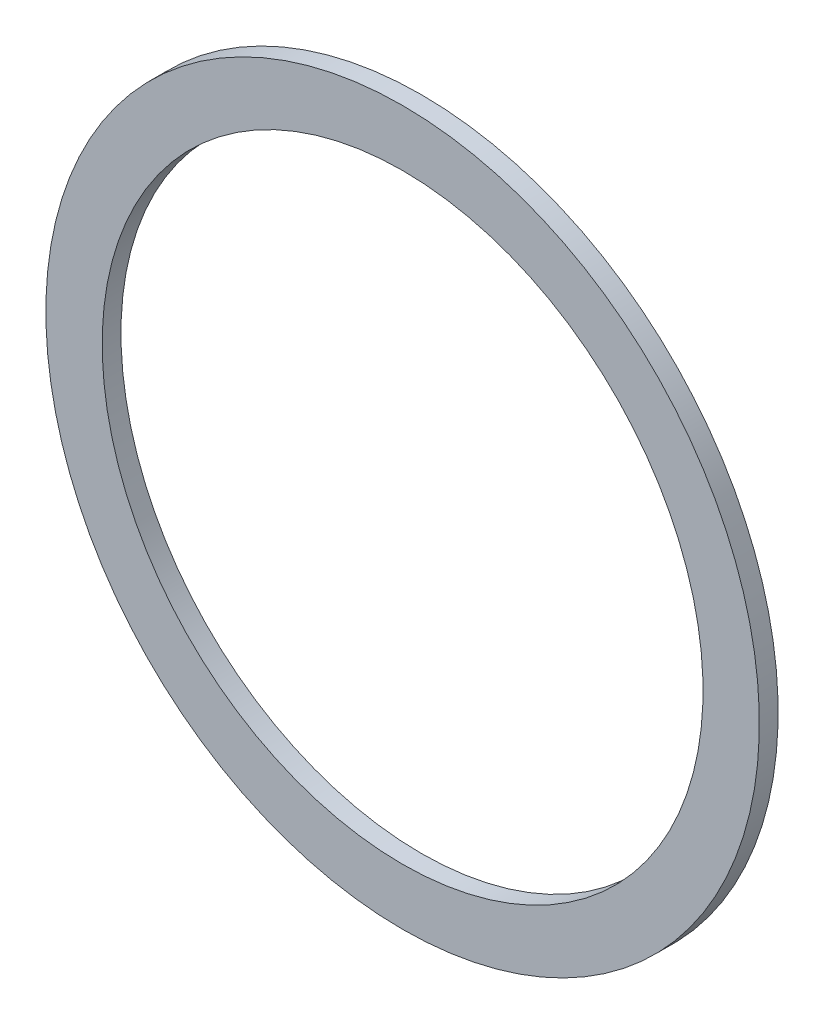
ISO-10303-21;
HEADER;
FILE_DESCRIPTION(('STEP AP214'),'2;1');
FILE_NAME('part.step','',(''),(''),'','','');
FILE_SCHEMA(('AUTOMOTIVE_DESIGN { 1 0 10303 214 1 1 1 1 }'));
ENDSEC;
DATA;
#1=APPLICATION_CONTEXT('core data for automotive mechanical design processes');
#2=APPLICATION_PROTOCOL_DEFINITION('international standard','automotive_design',2000,#1);
#3=PRODUCT_CONTEXT('',#1,'mechanical');
#4=PRODUCT('Part','Part','',(#3));
#5=PRODUCT_RELATED_PRODUCT_CATEGORY('part','',(#4));
#6=PRODUCT_DEFINITION_FORMATION('','',#4);
#7=PRODUCT_DEFINITION_CONTEXT('part definition',#1,'design');
#8=PRODUCT_DEFINITION('design','',#6,#7);
#9=PRODUCT_DEFINITION_SHAPE('','',#8);
#10=(LENGTH_UNIT() NAMED_UNIT(*) SI_UNIT(.MILLI.,.METRE.));
#11=(NAMED_UNIT(*) PLANE_ANGLE_UNIT() SI_UNIT($,.RADIAN.));
#12=(NAMED_UNIT(*) SI_UNIT($,.STERADIAN.) SOLID_ANGLE_UNIT());
#13=UNCERTAINTY_MEASURE_WITH_UNIT(LENGTH_MEASURE(1.E-05),#10,'distance_accuracy_value','');
#14=(GEOMETRIC_REPRESENTATION_CONTEXT(3) GLOBAL_UNCERTAINTY_ASSIGNED_CONTEXT((#13)) GLOBAL_UNIT_ASSIGNED_CONTEXT((#10,
#11,#12)) REPRESENTATION_CONTEXT('',''));
#15=CARTESIAN_POINT('',(0.,0.,0.));
#16=DIRECTION('',(0.,0.,1.));
#17=DIRECTION('',(1.,0.,0.));
#18=AXIS2_PLACEMENT_3D('',#15,#16,#17);
#19=CARTESIAN_POINT('',(0.,0.,0.));
#20=DIRECTION('',(0.,0.,-1.));
#21=DIRECTION('',(0.,-1.,0.));
#22=AXIS2_PLACEMENT_3D('',#19,#20,#21);
#23=CYLINDRICAL_SURFACE('',#22,16.);
#24=CARTESIAN_POINT('',(0.,0.,0.));
#25=DIRECTION('',(0.,0.,1.));
#26=DIRECTION('',(0.,1.,0.));
#27=AXIS2_PLACEMENT_3D('',#24,#25,#26);
#28=CIRCLE('',#27,16.);
#29=CARTESIAN_POINT('',(0.,16.,0.));
#30=VERTEX_POINT('',#29);
#31=EDGE_CURVE('E11',#30,#30,#28,.T.);
#32=ORIENTED_EDGE('',*,*,#31,.T.);
#33=EDGE_LOOP('',(#32));
#34=FACE_BOUND('',#33,.T.);
#35=CARTESIAN_POINT('',(0.,0.,-1.));
#36=DIRECTION('',(0.,0.,1.));
#37=DIRECTION('',(0.,1.,0.));
#38=AXIS2_PLACEMENT_3D('',#35,#36,#37);
#39=CIRCLE('',#38,16.);
#40=CARTESIAN_POINT('',(0.,-16.,-1.));
#41=VERTEX_POINT('',#40);
#42=EDGE_CURVE('E62',#41,#41,#39,.T.);
#43=ORIENTED_EDGE('',*,*,#42,.F.);
#44=EDGE_LOOP('',(#43));
#45=FACE_BOUND('',#44,.T.);
#46=ADVANCED_FACE('F16',(#34,#45),#23,.F.);
#47=CARTESIAN_POINT('',(0.,0.,0.));
#48=DIRECTION('',(0.,0.,-1.));
#49=DIRECTION('',(0.,-1.,0.));
#50=AXIS2_PLACEMENT_3D('',#47,#48,#49);
#51=CYLINDRICAL_SURFACE('',#50,19.);
#52=CARTESIAN_POINT('',(0.,0.,0.));
#53=DIRECTION('',(0.,0.,1.));
#54=DIRECTION('',(0.,1.,0.));
#55=AXIS2_PLACEMENT_3D('',#52,#53,#54);
#56=CIRCLE('',#55,19.);
#57=CARTESIAN_POINT('',(0.,-19.,0.));
#58=VERTEX_POINT('',#57);
#59=EDGE_CURVE('E46',#58,#58,#56,.T.);
#60=ORIENTED_EDGE('',*,*,#59,.F.);
#61=EDGE_LOOP('',(#60));
#62=FACE_BOUND('',#61,.T.);
#63=CARTESIAN_POINT('',(0.,0.,-1.));
#64=DIRECTION('',(0.,0.,1.));
#65=DIRECTION('',(0.,1.,0.));
#66=AXIS2_PLACEMENT_3D('',#63,#64,#65);
#67=CIRCLE('',#66,19.);
#68=CARTESIAN_POINT('',(0.,-19.,-1.));
#69=VERTEX_POINT('',#68);
#70=EDGE_CURVE('E26',#69,#69,#67,.T.);
#71=ORIENTED_EDGE('',*,*,#70,.T.);
#72=EDGE_LOOP('',(#71));
#73=FACE_BOUND('',#72,.T.);
#74=ADVANCED_FACE('F69',(#62,#73),#51,.T.);
#75=CARTESIAN_POINT('',(0.,0.,0.));
#76=DIRECTION('',(0.,0.,1.));
#77=DIRECTION('',(-1.,0.,0.));
#78=AXIS2_PLACEMENT_3D('',#75,#76,#77);
#79=PLANE('',#78);
#80=ORIENTED_EDGE('',*,*,#59,.T.);
#81=EDGE_LOOP('',(#80));
#82=FACE_BOUND('',#81,.T.);
#83=ORIENTED_EDGE('',*,*,#31,.F.);
#84=EDGE_LOOP('',(#83));
#85=FACE_BOUND('',#84,.T.);
#86=ADVANCED_FACE('F18',(#82,#85),#79,.T.);
#87=CARTESIAN_POINT('',(0.,0.,-1.));
#88=DIRECTION('',(0.,0.,1.));
#89=DIRECTION('',(-1.,0.,0.));
#90=AXIS2_PLACEMENT_3D('',#87,#88,#89);
#91=PLANE('',#90);
#92=ORIENTED_EDGE('',*,*,#70,.F.);
#93=EDGE_LOOP('',(#92));
#94=FACE_BOUND('',#93,.T.);
#95=ORIENTED_EDGE('',*,*,#42,.T.);
#96=EDGE_LOOP('',(#95));
#97=FACE_BOUND('',#96,.T.);
#98=ADVANCED_FACE('F53',(#94,#97),#91,.F.);
#99=CLOSED_SHELL('',(#46,#74,#86,#98));
#100=MANIFOLD_SOLID_BREP('B1',#99);
#101=ADVANCED_BREP_SHAPE_REPRESENTATION('',(#18,#100),#14);
#102=SHAPE_DEFINITION_REPRESENTATION(#9,#101);
ENDSEC;
END-ISO-10303-21;
